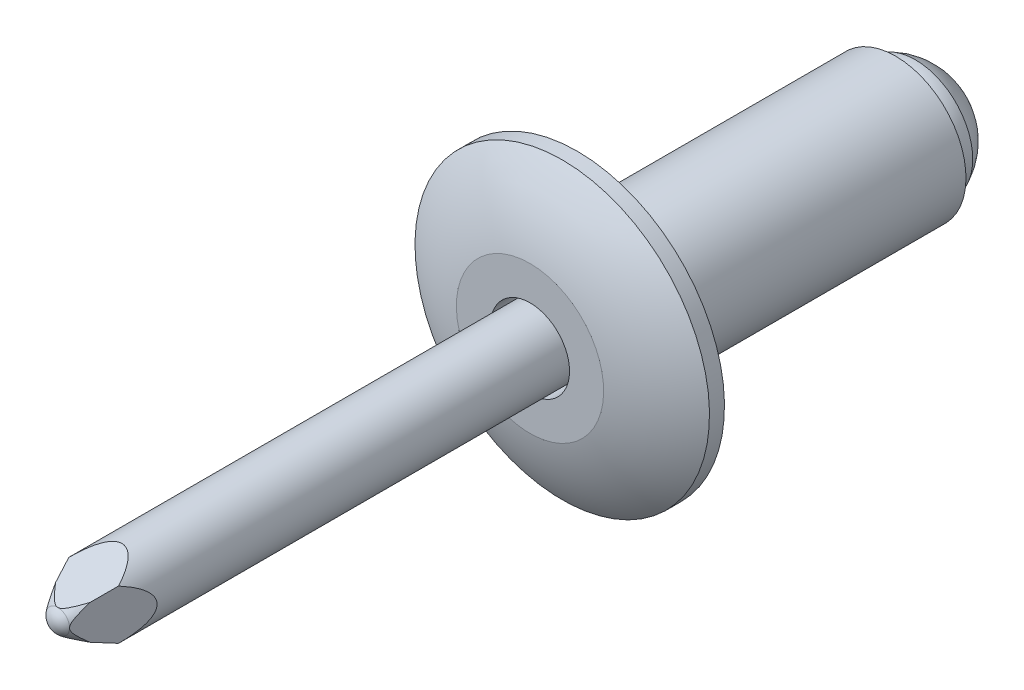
from build123d import *

# Parameters (mm, degrees)
CUT_EXTRUDE1_DEPTH = 20.141638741
CIRPATTERN1_COUNT  = 2
CIRPATTERN1_ANGLE  = 90
SKETCH9_W          = 0.147727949
SKETCH9_H          = 0.0254
SKETCH9_W_2        = 0.14772795


with BuildPart() as part:
    # Sketch2 → Revolve1 (revolve)
    with BuildSketch(Plane(origin=(0, 0, 0), x_dir=(0, 0, -1), z_dir=(1, 0, 0))):
        with BuildLine():
            Line((10.795, 2.38125), (0, 2.38125))
            Line((0, 2.38125), (0, 4.9911))
            Line((0, 4.9911), (-0.508, 4.9911))
            ThreePointArc((-0.508, 4.9911), (-1.18607536, 3.801085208), (-1.6002, 2.49555))
            Line((-1.6002, 2.49555), (-1.6002, 1.339453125))
            Line((-1.6002, 1.339453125), (0, 1.339453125))
            Line((0, 1.339453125), (1.0795, 1.339453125))
            Line((1.0795, 1.339453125), (1.0795, 0))
            Line((1.0795, 0), (10.795, 0))
            Line((10.795, 0), (10.795, 2.38125))
        make_face()
    revolve(axis=Axis((0, 0, -10.795), (0, 0, 1)))

    # Sketch9 → Revolve4 (revolve)
    with BuildSketch(Plane(origin=(0, 0, 0), x_dir=(1, 0, 0), z_dir=(0, 1, 0))):
        with Locations((3.127273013, 0.0127)):
            Rectangle(SKETCH9_W, SKETCH9_H)
        with Locations((3.53598544, 0.0127)):
            Rectangle(SKETCH9_W_2, SKETCH9_H)
        with Locations((3.900378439, 0.0127)):
            Rectangle(SKETCH9_W, SKETCH9_H)
        with Locations((4.427274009, 0.0127)):
            Rectangle(SKETCH9_W, SKETCH9_H)
        with Locations((2.787499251, 0.0127)):
            Rectangle(SKETCH9_W_2, SKETCH9_H)
    revolve(axis=Axis((0, 0, 17.7927), (0, 0, -1)))


with BuildPart() as body_2:
    # Sketch7 → Revolve2 (revolve)
    with BuildSketch(Plane(origin=(0, 0, 0), x_dir=(0, 0, -1), z_dir=(1, 0, 0))):
        with BuildLine():
            Line((-16.663244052, 1.190625), (1.0795, 1.190625))
            Line((1.0795, 1.190625), (1.0795, 0))
            Line((1.0795, 0), (-17.7927, 0))
            ThreePointArc((-17.7927, 0), (-17.743895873, 0.220141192), (-17.606628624, 0.399031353))
            Line((-17.606628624, 0.399031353), (-16.663244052, 1.190625))
        make_face()
    revolve(axis=Axis((0, 0, 17.7927), (0, 0, -1)))

    # Sketch3 → Cut-Extrude1 (cut, symmetric)
    with BuildSketch(Plane(origin=(0, 0, 0), x_dir=(1, 0, 0), z_dir=(0, 1, 0))):
        Polygon((-1.393825, -14.873455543), (-0.331306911, -17.7927), (0.331306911, -17.7927), (1.393825, -14.873455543), (1.393825, -18.3007), (-1.393825, -18.3007), align=None)
    cut_extrude1 = extrude(amount=CUT_EXTRUDE1_DEPTH, both=True, mode=Mode.SUBTRACT)

    # CirPattern1: Cut-Extrude1 ×2 about axis
    cirpattern1_axis = Axis((0, 0, 17.7927), (0, 0, -1))
    for i in range(1, CIRPATTERN1_COUNT):
        add(cut_extrude1.rotate(cirpattern1_axis, i * CIRPATTERN1_ANGLE / (CIRPATTERN1_COUNT - 1)), mode=Mode.SUBTRACT)


with BuildPart() as body_3:
    # Sketch8 → Revolve3 (revolve)
    with BuildSketch(Plane(origin=(0, 0, 0), x_dir=(0, 0, -1), z_dir=(1, 0, 0)), mode=Mode.PRIVATE) as revolve3_sk:
        with BuildLine():
            Line((10.795, 1.905), (10.795, 0))
            Line((10.795, 0), (12.706274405, 0))
            ThreePointArc((12.706274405, 0), (12.368340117, 1.154012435), (11.461296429, 1.943452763))
            ThreePointArc((11.461296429, 1.943452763), (11.126496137, 1.952853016), (10.795, 1.905))
        make_face()
    revolve(revolve3_sk.sketch.rotate(Axis((0, 0, -10.795), (0, 0, -1)), 90), axis=Axis((0, 0, -10.795), (0, 0, -1)))


solid = Compound([part.part, body_2.part, body_3.part])
